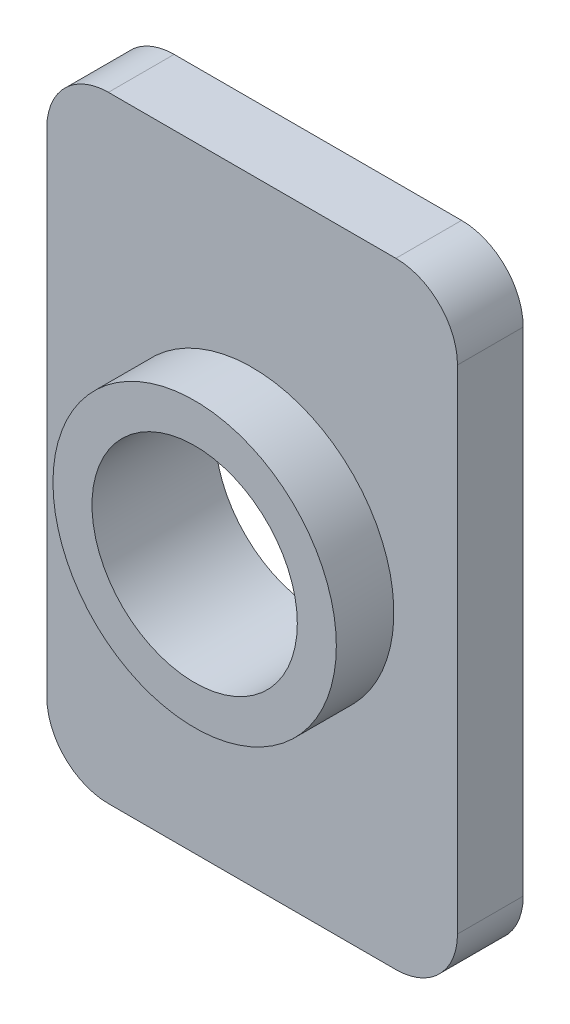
from build123d import *

# Parameters (mm, degrees)
SKETCH1_W        = 10
SKETCH1_H        = 15
EXTRUSION1_DEPTH = 1.6
SKETCH2_R        = 3.45
EXTRUSION2_DEPTH = 1.4
HOLE1_D          = 5
FILLET1_R        = 1.5


with BuildPart() as part:
    # Sketch1 → Extrusion1 (new body)
    with BuildSketch(Plane.XY):
        Rectangle(SKETCH1_W, SKETCH1_H)
    extrude(amount=EXTRUSION1_DEPTH)

    # Sketch2 → Extrusion2 (add)
    with BuildSketch(Plane.XY.offset(1.6)):
        with Locations(Location((0, 0, 0), (0, 0, 180))):
            Circle(SKETCH2_R)
    extrude(amount=EXTRUSION2_DEPTH)

    # Hole1 (through all)
    with Locations(Plane.XY.offset(3)):
        with Locations((0, 0)):
            Hole(HOLE1_D / 2)

    # Fillet1
    fillet1_edges = [part.edges().sort_by_distance(p)[0] for p in [
        (-5, 7.5, 0.8),
        (5, 7.5, 0.8),
        (5, -7.5, 0.8),
        (-5, -7.5, 0.8),
    ]]
    fillet(fillet1_edges, radius=FILLET1_R)


solid = part.part
